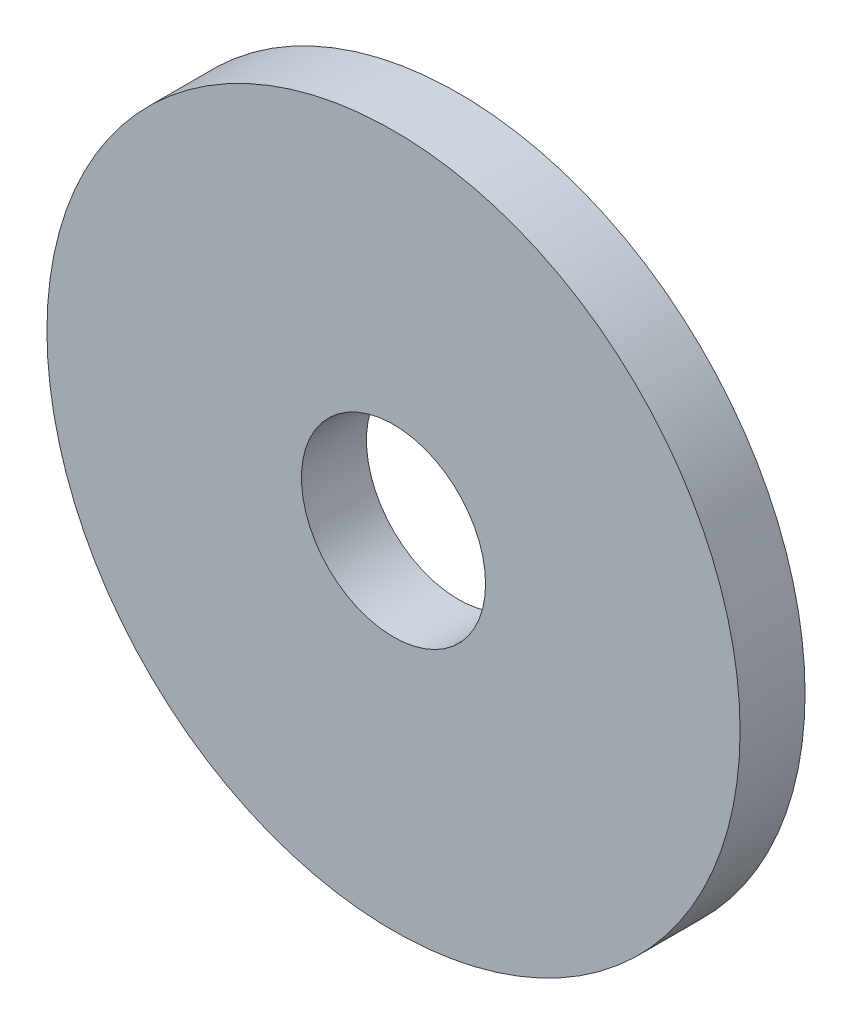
from build123d import *

# Parameters (mm, degrees)
ESQUISSE1_R        = 16
ESQUISSE1_R_2      = 4.25
BOSS_EXTRU_1_DEPTH = 3


with BuildPart() as part:
    # Esquisse1 → Boss.-Extru.1 (new body)
    with BuildSketch(Plane.XY):
        Circle(ESQUISSE1_R)
        Circle(ESQUISSE1_R_2, mode=Mode.SUBTRACT)
    extrude(amount=BOSS_EXTRU_1_DEPTH)


solid = part.part
